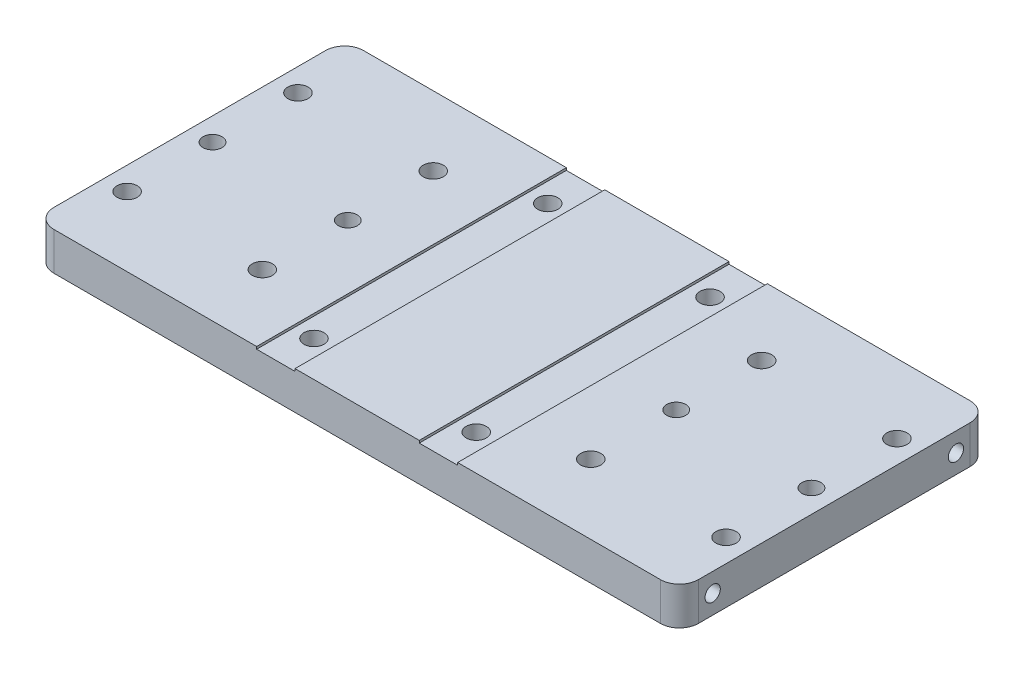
from build123d import *

# Parameters (mm, degrees)
SKETCH1_W                                        = 215.5698
SKETCH1_H                                        = 103.5812
BOSS_EXTRUDE1_DEPTH                              = 6.35
SKETCH2_W                                        = 12.827
SKETCH2_H                                        = 0.79850742
CUT_EXTRUDE1_DEPTH                               = 150.622766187
CBORE_FOR_1_4_SOCKET_HEAD_CAP_SCREW1_D           = 6.7564
CBORE_FOR_1_4_SOCKET_HEAD_CAP_SCREW1_CBORE_D     = 11.1125
CBORE_FOR_1_4_SOCKET_HEAD_CAP_SCREW1_CBORE_DEPTH = 6.35
F_1_4_20_TAPPED_HOLE1_AT_2_COUNT                 = 2
F_1_4_20_TAPPED_HOLE1_AT_2_PITCH                 = 81.3562
CBORE_FOR_1_4_SOCKET_HEAD_CAP_SCREW2_D           = 6.7564
CBORE_FOR_1_4_SOCKET_HEAD_CAP_SCREW2_CBORE_D     = 11.1125
CBORE_FOR_1_4_SOCKET_HEAD_CAP_SCREW2_CBORE_DEPTH = 6.35
F_1_4_0_2500_DOWEL_HOLE1_D                       = 6.35
FILLET1_R                                        = 6.35


with BuildPart() as part:
    # Sketch1 → Boss-Extrude1 (new, symmetric)
    with BuildSketch(Plane(origin=(0, 0, 0), x_dir=(1, 0, 0), z_dir=(0, 1, 0))):
        Rectangle(SKETCH1_W, SKETCH1_H)
    extrude(amount=BOSS_EXTRUDE1_DEPTH, both=True)

    # Sketch2 → Cut-Extrude1 (cut, through all)
    with BuildSketch(Plane(origin=(0, 0, -51.7906), x_dir=(-1, 0, 0), z_dir=(0, 0, -1))):
        with Locations((-27.1907001, 5.95074629)):
            Rectangle(SKETCH2_W, SKETCH2_H)
        with Locations((27.1907001, 5.95074629)):
            Rectangle(SKETCH2_W, SKETCH2_H)
    extrude(amount=-CUT_EXTRUDE1_DEPTH, mode=Mode.SUBTRACT)

    # CBORE for 1_4 Socket Head Cap Screw1 (through all)
    with Locations(Plane(origin=(0, -6.35, 0), x_dir=(-1, 0, 0), z_dir=(0, -1, 0))):
        with Locations((27.1272, 39.0906), (27.1272, -39.0906), (-27.1272, -39.0906), (-27.1272, 39.0906)):
            CounterBoreHole(CBORE_FOR_1_4_SOCKET_HEAD_CAP_SCREW1_D / 2, CBORE_FOR_1_4_SOCKET_HEAD_CAP_SCREW1_CBORE_D / 2, CBORE_FOR_1_4_SOCKET_HEAD_CAP_SCREW1_CBORE_DEPTH)

    # Sketch6 → 1_4-20 Tapped Hole1 (revolve, cut)
    with BuildSketch(Plane(origin=(107.7849, 0, 40.6781), x_dir=(0, 0, -1), z_dir=(0, 1, 0))):
        Polygon((0, 0), (0, 18.043816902), (2.5527, 16.51), (2.5527, 0), align=None)
    f_1_4_20_tapped_hole1 = revolve(axis=Axis((114.1349, 0, 40.6781), (-1, 0, 0)), mode=Mode.SUBTRACT)

    # 1_4-20 Tapped Hole1 at 2: 1_4-20 Tapped Hole1 ×2
    with Locations(*[(0, 0, -i * F_1_4_20_TAPPED_HOLE1_AT_2_PITCH) for i in range(1, F_1_4_20_TAPPED_HOLE1_AT_2_COUNT)]):
        add(f_1_4_20_tapped_hole1, mode=Mode.SUBTRACT)

    # CBORE for 1_4 Socket Head Cap Screw2 (through all)
    with Locations(Plane(origin=(0, -6.35, 0), x_dir=(-1, 0, 0), z_dir=(0, -1, 0))):
        with Locations((54.9148, 28.575), (54.9148, -28.575), (100.1522, -28.575), (100.1522, 28.575), (-100.1522, -28.575), (-100.1522, 28.575), (-54.9148, -28.575), (-54.9148, 28.575)):
            CounterBoreHole(CBORE_FOR_1_4_SOCKET_HEAD_CAP_SCREW2_D / 2, CBORE_FOR_1_4_SOCKET_HEAD_CAP_SCREW2_CBORE_D / 2, CBORE_FOR_1_4_SOCKET_HEAD_CAP_SCREW2_CBORE_DEPTH)

    # 1_4 _0.2500_ Dowel Hole1 (through all)
    with Locations(Plane(origin=(0, 6.35, 0), x_dir=(1, 0, 0), z_dir=(0, 1, 0))):
        with Locations((100.1522, 0), (54.9148, 0), (-100.1522, 0), (-54.9148, 0)):
            Hole(F_1_4_0_2500_DOWEL_HOLE1_D / 2)

    # Mirror1: 1_4-20 Tapped Hole1 across plane
    add(f_1_4_20_tapped_hole1.mirror(Plane(origin=(0, 0, 0), x_dir=(0, 0, 1), z_dir=(1, 0, 0))), mode=Mode.SUBTRACT)

    # Mirror1 copy 1 sketch → Mirror1 copy 1 (revolve, cut)
    with BuildSketch(Plane(origin=(-107.7849, 0, -40.6781), x_dir=(0, 0, -1), z_dir=(0, 1, 0))):
        Polygon((0, 0), (0, -18.043816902), (2.5527, -16.51), (2.5527, 0), align=None)
    revolve(axis=Axis((-114.1349, 0, -40.6781), (-1, 0, 0)), mode=Mode.SUBTRACT)

    # Fillet1
    fillet1_edges = [part.edges().sort_by_distance(p)[0] for p in [
        (107.7849, 0, 51.7906),
        (-107.7849, 0, 51.7906),
        (-107.7849, 0, -51.7906),
        (107.7849, 0, -51.7906),
    ]]
    fillet(fillet1_edges, radius=FILLET1_R)


solid = part.part
